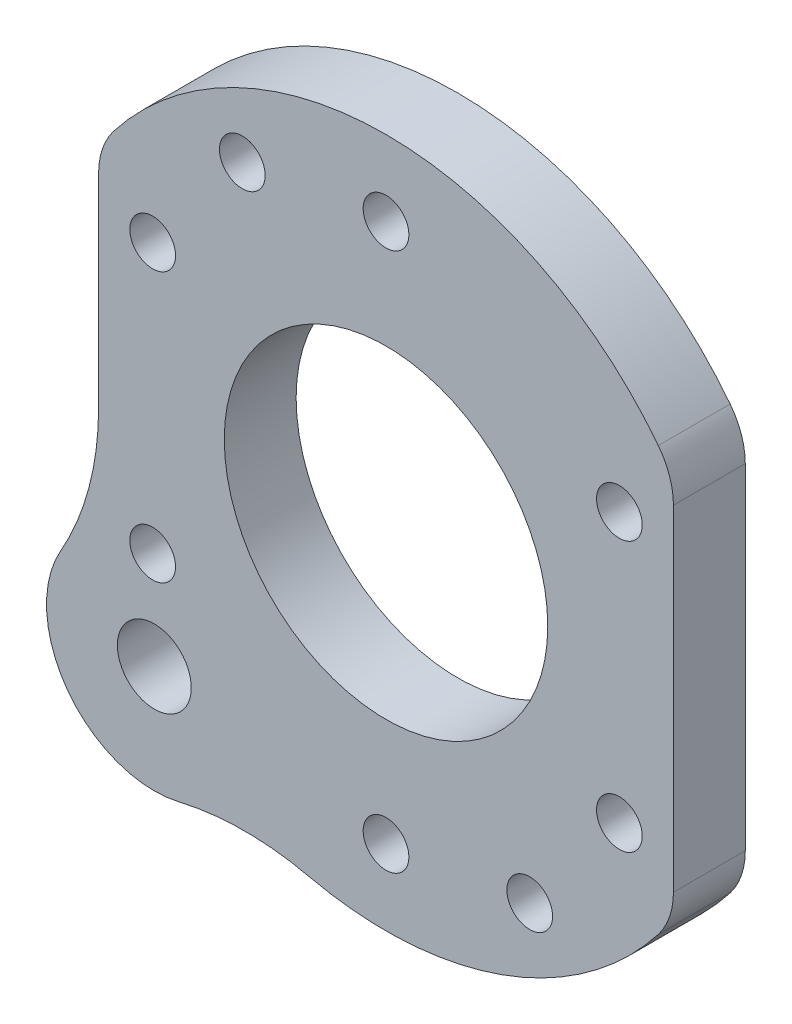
from build123d import *

# Parameters (mm, degrees)
BOSS_EXTRUDE1_DEPTH        = 6.35
TAP_DRILL_FOR_10_32_TAP3_D = 4.0386
CIRPATTERN1_COUNT          = 6
FILLET1_R                  = 6.35
BOSS_EXTRUDE2_DEPTH        = 6.35
F_5_16_18_TAPPED_HOLE1_D   = 6.5278
FILLET2_R                  = 25.4
SKETCH10_R                 = 14.29385
CUT_EXTRUDE2_DEPTH         = 6.35
F_10_32_TAPPED_HOLE1_D     = 4.0386


with BuildPart() as part:
    # Sketch1 → Boss-Extrude1 (new body)
    with BuildSketch(Plane.XY):
        with BuildLine():
            ThreePointArc((25.4, 16.848453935), (0, 30.48), (-25.4, 16.848453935))
            Line((-25.4, 16.848453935), (-25.4, -16.848453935))
            ThreePointArc((-25.4, -16.848453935), (0, -30.48), (25.4, -16.848453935))
            Line((25.4, -16.848453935), (25.4, 16.848453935))
        make_face()
        Polygon((-3.666174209, -6.35), (-7.332348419, 0), (-3.666174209, 6.35), (3.666174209, 6.35), (7.332348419, 0), (3.666174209, -6.35), align=None, mode=Mode.SUBTRACT)
    extrude(amount=BOSS_EXTRUDE1_DEPTH)

    # Tap Drill for _10-32 Tap3 (through all)
    with Locations(Plane(origin=(0, 23.8125, 6.35), x_dir=(1, 0, 0), z_dir=(0, 0, 1))):
        with Locations((0, 0)):
            tap_drill_for_10_32_tap3 = Hole(TAP_DRILL_FOR_10_32_TAP3_D / 2)

    # CirPattern1: Tap Drill for _10-32 Tap3 ×6 about axis
    cirpattern1_axis = Axis((0, 0, 0), (0, 0, 1))
    for i in range(1, CIRPATTERN1_COUNT):
        add(tap_drill_for_10_32_tap3.rotate(cirpattern1_axis, i * 360 / CIRPATTERN1_COUNT), mode=Mode.SUBTRACT)

    # Fillet1
    fillet1_edges = [part.edges().sort_by_distance(p)[0] for p in [
        (25.4, -16.848453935, 3.175),
        (-25.4, -16.848453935, 3.175),
        (-25.4, 16.848453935, 3.175),
        (25.4, 16.848453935, 3.175),
    ]]
    fillet(fillet1_edges, radius=FILLET1_R)

    # Sketch6 → Boss-Extrude2 (add)
    with BuildSketch(Plane(origin=(0, 0, 0), x_dir=(-1, 0, 0), z_dir=(0, 0, -1))):
        with BuildLine():
            ThreePointArc((24.063157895, -18.708148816), (19.372553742, -23.531565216), (13.738019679, -27.208403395))
            ThreePointArc((13.738019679, -27.208403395), (24.118885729, -29.27541604), (29.999983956, -20.474983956))
            ThreePointArc((29.999983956, -20.474983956), (28.770657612, -15.794447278), (25.4, -12.322080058))
            Line((25.4, -12.322080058), (25.4, -14.810617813))
            ThreePointArc((25.4, -14.810617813), (25.056498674, -16.870829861), (24.063157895, -18.708148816))
        make_face()
    extrude(amount=-BOSS_EXTRUDE2_DEPTH)

    # 5_16-18 Tapped Hole1 (through all)
    with Locations(Plane(origin=(0, 0, 0), x_dir=(-1, 0, 0), z_dir=(0, 0, -1))):
        with Locations((20.474983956, -20.474983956)):
            Hole(F_5_16_18_TAPPED_HOLE1_D / 2)

    # Fillet2
    fillet2_edges = [part.edges().sort_by_distance(p)[0] for p in [
        (-13.738019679, -27.208403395, 3.175),
        (-25.4, -12.322080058, 3.175),
    ]]
    fillet(fillet2_edges, radius=FILLET2_R)

    # Sketch10 → Cut-Extrude2 (cut)
    with BuildSketch(Plane.XY.offset(6.35)):
        Circle(SKETCH10_R)
    extrude(amount=-CUT_EXTRUDE2_DEPTH, mode=Mode.SUBTRACT)

    # 10-32 Tapped Hole1 (through all)
    with Locations(Plane(origin=(-12.7, 21.997045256, 6.35), x_dir=(1, 0, 0), z_dir=(0, 0, 1))):
        with Locations((0, 0), (25.4, -43.994090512)):
            Hole(F_10_32_TAPPED_HOLE1_D / 2)


solid = part.part
